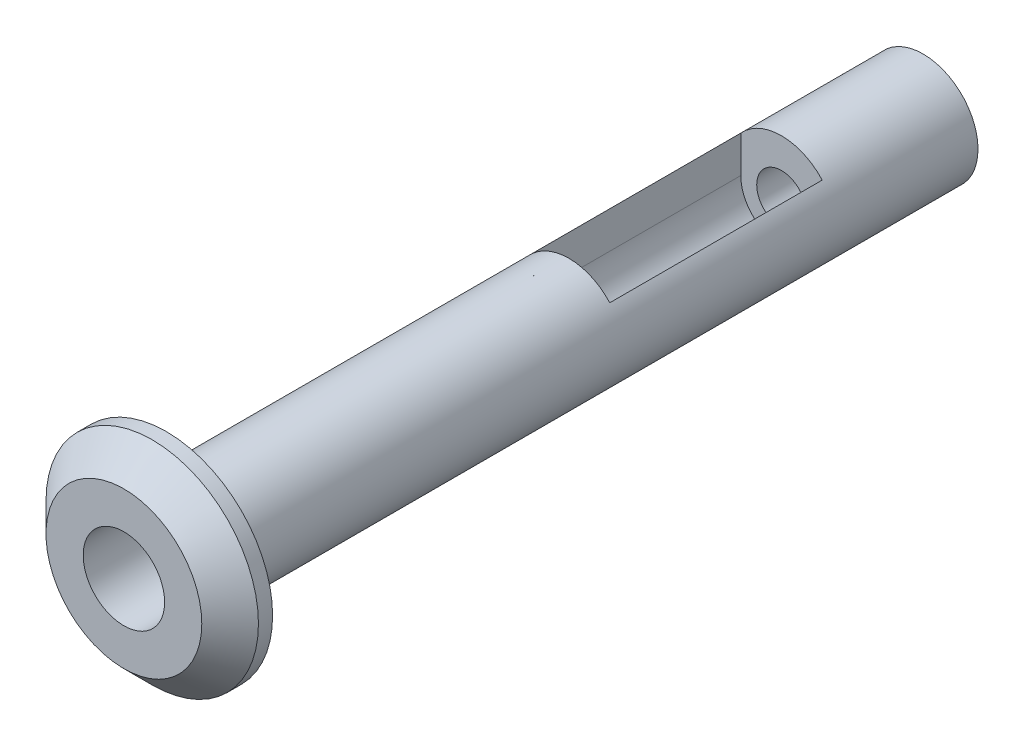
ISO-10303-21;
HEADER;
FILE_DESCRIPTION(('STEP AP214'),'2;1');
FILE_NAME('part.step','',(''),(''),'','','');
FILE_SCHEMA(('AUTOMOTIVE_DESIGN { 1 0 10303 214 1 1 1 1 }'));
ENDSEC;
DATA;
#1=APPLICATION_CONTEXT('core data for automotive mechanical design processes');
#2=APPLICATION_PROTOCOL_DEFINITION('international standard','automotive_design',2000,#1);
#3=PRODUCT_CONTEXT('',#1,'mechanical');
#4=PRODUCT('Part','Part','',(#3));
#5=PRODUCT_RELATED_PRODUCT_CATEGORY('part','',(#4));
#6=PRODUCT_DEFINITION_FORMATION('','',#4);
#7=PRODUCT_DEFINITION_CONTEXT('part definition',#1,'design');
#8=PRODUCT_DEFINITION('design','',#6,#7);
#9=PRODUCT_DEFINITION_SHAPE('','',#8);
#10=(LENGTH_UNIT() NAMED_UNIT(*) SI_UNIT(.MILLI.,.METRE.));
#11=(NAMED_UNIT(*) PLANE_ANGLE_UNIT() SI_UNIT($,.RADIAN.));
#12=(NAMED_UNIT(*) SI_UNIT($,.STERADIAN.) SOLID_ANGLE_UNIT());
#13=UNCERTAINTY_MEASURE_WITH_UNIT(LENGTH_MEASURE(1.E-05),#10,'distance_accuracy_value','');
#14=(GEOMETRIC_REPRESENTATION_CONTEXT(3) GLOBAL_UNCERTAINTY_ASSIGNED_CONTEXT((#13)) GLOBAL_UNIT_ASSIGNED_CONTEXT((#10,
#11,#12)) REPRESENTATION_CONTEXT('',''));
#15=CARTESIAN_POINT('',(0.,0.,0.));
#16=DIRECTION('',(0.,0.,1.));
#17=DIRECTION('',(1.,0.,0.));
#18=AXIS2_PLACEMENT_3D('',#15,#16,#17);
#19=CARTESIAN_POINT('',(0.,0.,-1.5));
#20=DIRECTION('',(0.,0.,1.));
#21=DIRECTION('',(1.,0.,0.));
#22=AXIS2_PLACEMENT_3D('',#19,#20,#21);
#23=PLANE('',#22);
#24=CARTESIAN_POINT('',(0.,0.,-1.5));
#25=DIRECTION('',(0.,0.,1.));
#26=DIRECTION('',(1.,0.,0.));
#27=AXIS2_PLACEMENT_3D('',#24,#25,#26);
#28=CIRCLE('',#27,7.5);
#29=CARTESIAN_POINT('',(7.5,0.,-1.5));
#30=VERTEX_POINT('',#29);
#31=EDGE_CURVE('E123',#30,#30,#28,.T.);
#32=ORIENTED_EDGE('',*,*,#31,.F.);
#33=EDGE_LOOP('',(#32));
#34=FACE_BOUND('',#33,.T.);
#35=CARTESIAN_POINT('',(0.,0.,-1.5));
#36=DIRECTION('',(0.,0.,1.));
#37=DIRECTION('',(1.,0.,0.));
#38=AXIS2_PLACEMENT_3D('',#35,#36,#37);
#39=CIRCLE('',#38,3.875);
#40=CARTESIAN_POINT('',(3.875,0.,-1.5));
#41=VERTEX_POINT('',#40);
#42=EDGE_CURVE('E49',#41,#41,#39,.F.);
#43=ORIENTED_EDGE('',*,*,#42,.F.);
#44=EDGE_LOOP('',(#43));
#45=FACE_BOUND('',#44,.T.);
#46=ADVANCED_FACE('F40',(#34,#45),#23,.F.);
#47=CARTESIAN_POINT('',(0.,0.,1.5));
#48=DIRECTION('',(0.,0.,1.));
#49=DIRECTION('',(1.,0.,0.));
#50=AXIS2_PLACEMENT_3D('',#47,#48,#49);
#51=PLANE('',#50);
#52=CARTESIAN_POINT('',(0.,0.,1.5));
#53=DIRECTION('',(0.,0.,1.));
#54=DIRECTION('',(1.,0.,0.));
#55=AXIS2_PLACEMENT_3D('',#52,#53,#54);
#56=CIRCLE('',#55,2.875);
#57=CARTESIAN_POINT('',(2.875,0.,1.5));
#58=VERTEX_POINT('',#57);
#59=EDGE_CURVE('E91',#58,#58,#56,.T.);
#60=ORIENTED_EDGE('',*,*,#59,.F.);
#61=EDGE_LOOP('',(#60));
#62=FACE_BOUND('',#61,.T.);
#63=CARTESIAN_POINT('',(0.,0.,1.5));
#64=DIRECTION('',(0.,0.,1.));
#65=DIRECTION('',(1.,0.,0.));
#66=AXIS2_PLACEMENT_3D('',#63,#64,#65);
#67=CIRCLE('',#66,5.5);
#68=CARTESIAN_POINT('',(5.5,0.,1.5));
#69=VERTEX_POINT('',#68);
#70=EDGE_CURVE('E126',#69,#69,#67,.T.);
#71=ORIENTED_EDGE('',*,*,#70,.T.);
#72=EDGE_LOOP('',(#71));
#73=FACE_BOUND('',#72,.T.);
#74=ADVANCED_FACE('F159',(#62,#73),#51,.T.);
#75=CARTESIAN_POINT('',(0.,0.,1.5));
#76=DIRECTION('',(0.,0.,-1.));
#77=DIRECTION('',(-1.,0.,0.));
#78=AXIS2_PLACEMENT_3D('',#75,#76,#77);
#79=CYLINDRICAL_SURFACE('',#78,7.5);
#80=CARTESIAN_POINT('',(0.,0.,-0.500000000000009));
#81=DIRECTION('',(0.,0.,1.));
#82=DIRECTION('',(1.,0.,0.));
#83=AXIS2_PLACEMENT_3D('',#80,#81,#82);
#84=CIRCLE('',#83,7.5);
#85=CARTESIAN_POINT('',(7.5,0.,-0.500000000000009));
#86=VERTEX_POINT('',#85);
#87=EDGE_CURVE('E129',#86,#86,#84,.F.);
#88=ORIENTED_EDGE('',*,*,#87,.T.);
#89=EDGE_LOOP('',(#88));
#90=FACE_BOUND('',#89,.T.);
#91=ORIENTED_EDGE('',*,*,#31,.T.);
#92=EDGE_LOOP('',(#91));
#93=FACE_BOUND('',#92,.T.);
#94=ADVANCED_FACE('F141',(#90,#93),#79,.T.);
#95=CARTESIAN_POINT('',(0.,0.,1.5));
#96=DIRECTION('',(0.,0.,-1.));
#97=DIRECTION('',(-1.,0.,0.));
#98=AXIS2_PLACEMENT_3D('',#95,#96,#97);
#99=CYLINDRICAL_SURFACE('',#98,1.75);
#100=CARTESIAN_POINT('',(0.,0.,-44.93));
#101=DIRECTION('',(0.,0.,-1.));
#102=DIRECTION('',(-1.,0.,0.));
#103=AXIS2_PLACEMENT_3D('',#100,#101,#102);
#104=CIRCLE('',#103,1.75);
#105=CARTESIAN_POINT('',(-1.75,0.,-44.93));
#106=VERTEX_POINT('',#105);
#107=EDGE_CURVE('E116',#106,#106,#104,.T.);
#108=ORIENTED_EDGE('',*,*,#107,.F.);
#109=EDGE_LOOP('',(#108));
#110=FACE_BOUND('',#109,.T.);
#111=CARTESIAN_POINT('',(0.,0.,-54.93));
#112=DIRECTION('',(0.,0.,-1.));
#113=DIRECTION('',(-1.,0.,0.));
#114=AXIS2_PLACEMENT_3D('',#111,#112,#113);
#115=CIRCLE('',#114,1.75);
#116=CARTESIAN_POINT('',(-1.75,0.,-54.93));
#117=VERTEX_POINT('',#116);
#118=EDGE_CURVE('E117',#117,#117,#115,.T.);
#119=ORIENTED_EDGE('',*,*,#118,.T.);
#120=EDGE_LOOP('',(#119));
#121=FACE_BOUND('',#120,.T.);
#122=ADVANCED_FACE('F138',(#110,#121),#99,.F.);
#123=CARTESIAN_POINT('',(0.,0.,1.5));
#124=DIRECTION('',(0.,0.,-1.));
#125=DIRECTION('',(-1.,0.,0.));
#126=AXIS2_PLACEMENT_3D('',#123,#124,#125);
#127=CONICAL_SURFACE('',#126,5.5,0.785398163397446);
#128=ORIENTED_EDGE('',*,*,#87,.F.);
#129=EDGE_LOOP('',(#128));
#130=FACE_BOUND('',#129,.T.);
#131=ORIENTED_EDGE('',*,*,#70,.F.);
#132=EDGE_LOOP('',(#131));
#133=FACE_BOUND('',#132,.T.);
#134=ADVANCED_FACE('F43',(#130,#133),#127,.T.);
#135=CARTESIAN_POINT('',(0.,0.,-54.93));
#136=DIRECTION('',(0.,0.,-1.));
#137=DIRECTION('',(-1.,0.,0.));
#138=AXIS2_PLACEMENT_3D('',#135,#136,#137);
#139=PLANE('',#138);
#140=CARTESIAN_POINT('',(0.,0.,-54.93));
#141=DIRECTION('',(0.,0.,-1.));
#142=DIRECTION('',(-1.,0.,0.));
#143=AXIS2_PLACEMENT_3D('',#140,#141,#142);
#144=CIRCLE('',#143,3.875);
#145=CARTESIAN_POINT('',(-3.875,0.,-54.93));
#146=VERTEX_POINT('',#145);
#147=EDGE_CURVE('E120',#146,#146,#144,.T.);
#148=ORIENTED_EDGE('',*,*,#147,.T.);
#149=EDGE_LOOP('',(#148));
#150=FACE_BOUND('',#149,.T.);
#151=ORIENTED_EDGE('',*,*,#118,.F.);
#152=EDGE_LOOP('',(#151));
#153=FACE_BOUND('',#152,.T.);
#154=ADVANCED_FACE('F145',(#150,#153),#139,.T.);
#155=CARTESIAN_POINT('',(0.,0.,-54.93));
#156=DIRECTION('',(0.,0.,1.));
#157=DIRECTION('',(1.,0.,0.));
#158=AXIS2_PLACEMENT_3D('',#155,#156,#157);
#159=CYLINDRICAL_SURFACE('',#158,3.875);
#160=DIRECTION('',(0.,0.,-1.));
#161=VECTOR('',#160,1.);
#162=CARTESIAN_POINT('',(2.875,2.59807621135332,-29.93));
#163=LINE('',#162,#161);
#164=CARTESIAN_POINT('',(2.875,2.59807621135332,-29.93));
#165=VERTEX_POINT('',#164);
#166=CARTESIAN_POINT('',(2.875,2.59807621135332,-44.93));
#167=VERTEX_POINT('',#166);
#168=EDGE_CURVE('E56',#165,#167,#163,.T.);
#169=ORIENTED_EDGE('',*,*,#168,.F.);
#170=CARTESIAN_POINT('',(0.,0.,-29.93));
#171=DIRECTION('',(0.,0.,1.));
#172=DIRECTION('',(-1.,0.,0.));
#173=AXIS2_PLACEMENT_3D('',#170,#171,#172);
#174=CIRCLE('',#173,3.875);
#175=CARTESIAN_POINT('',(-2.875,2.59807621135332,-29.93));
#176=VERTEX_POINT('',#175);
#177=EDGE_CURVE('E97',#165,#176,#174,.T.);
#178=ORIENTED_EDGE('',*,*,#177,.T.);
#179=DIRECTION('',(0.,0.,-1.));
#180=VECTOR('',#179,1.);
#181=CARTESIAN_POINT('',(-2.875,2.59807621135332,-29.93));
#182=LINE('',#181,#180);
#183=CARTESIAN_POINT('',(-2.875,2.59807621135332,-44.93));
#184=VERTEX_POINT('',#183);
#185=EDGE_CURVE('E103',#176,#184,#182,.T.);
#186=ORIENTED_EDGE('',*,*,#185,.T.);
#187=CARTESIAN_POINT('',(0.,0.,-44.93));
#188=DIRECTION('',(0.,0.,1.));
#189=DIRECTION('',(-1.,0.,0.));
#190=AXIS2_PLACEMENT_3D('',#187,#188,#189);
#191=CIRCLE('',#190,3.875);
#192=EDGE_CURVE('E283',#167,#184,#191,.T.);
#193=ORIENTED_EDGE('',*,*,#192,.F.);
#194=EDGE_LOOP('',(#169,#178,#186,#193));
#195=FACE_BOUND('',#194,.T.);
#196=ORIENTED_EDGE('',*,*,#147,.F.);
#197=EDGE_LOOP('',(#196));
#198=FACE_BOUND('',#197,.T.);
#199=ORIENTED_EDGE('',*,*,#42,.T.);
#200=EDGE_LOOP('',(#199));
#201=FACE_BOUND('',#200,.T.);
#202=ADVANCED_FACE('F147',(#195,#198,#201),#159,.T.);
#203=CARTESIAN_POINT('',(0.,0.,-44.93));
#204=DIRECTION('',(0.,0.,-1.));
#205=DIRECTION('',(-1.,0.,0.));
#206=AXIS2_PLACEMENT_3D('',#203,#204,#205);
#207=PLANE('',#206);
#208=CARTESIAN_POINT('',(0.,0.,-44.93));
#209=DIRECTION('',(0.,0.,-1.));
#210=DIRECTION('',(-1.,0.,0.));
#211=AXIS2_PLACEMENT_3D('',#208,#209,#210);
#212=CIRCLE('',#211,2.875);
#213=CARTESIAN_POINT('',(-2.875,0.,-44.93));
#214=VERTEX_POINT('',#213);
#215=CARTESIAN_POINT('',(2.875,0.,-44.93));
#216=VERTEX_POINT('',#215);
#217=EDGE_CURVE('E102',#214,#216,#212,.F.);
#218=ORIENTED_EDGE('',*,*,#217,.T.);
#219=DIRECTION('',(0.,1.,0.));
#220=VECTOR('',#219,1.);
#221=CARTESIAN_POINT('',(2.875,0.,-44.93));
#222=LINE('',#221,#220);
#223=EDGE_CURVE('E87',#216,#167,#222,.T.);
#224=ORIENTED_EDGE('',*,*,#223,.T.);
#225=ORIENTED_EDGE('',*,*,#192,.T.);
#226=DIRECTION('',(0.,-1.,0.));
#227=VECTOR('',#226,1.);
#228=CARTESIAN_POINT('',(-2.875,0.,-44.93));
#229=LINE('',#228,#227);
#230=EDGE_CURVE('E98',#184,#214,#229,.T.);
#231=ORIENTED_EDGE('',*,*,#230,.T.);
#232=EDGE_LOOP('',(#218,#224,#225,#231));
#233=FACE_BOUND('',#232,.T.);
#234=ORIENTED_EDGE('',*,*,#107,.T.);
#235=EDGE_LOOP('',(#234));
#236=FACE_BOUND('',#235,.T.);
#237=ADVANCED_FACE('F136',(#233,#236),#207,.F.);
#238=CARTESIAN_POINT('',(0.,0.,-63.0617279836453));
#239=DIRECTION('',(0.,0.,1.));
#240=DIRECTION('',(1.,0.,0.));
#241=AXIS2_PLACEMENT_3D('',#238,#239,#240);
#242=CYLINDRICAL_SURFACE('',#241,2.875);
#243=CARTESIAN_POINT('',(0.,0.,-29.93));
#244=DIRECTION('',(0.,0.,1.));
#245=DIRECTION('',(1.,0.,0.));
#246=AXIS2_PLACEMENT_3D('',#243,#244,#245);
#247=CIRCLE('',#246,2.875);
#248=CARTESIAN_POINT('',(-2.875,0.,-29.93));
#249=VERTEX_POINT('',#248);
#250=CARTESIAN_POINT('',(2.875,0.,-29.93));
#251=VERTEX_POINT('',#250);
#252=EDGE_CURVE('E12',#249,#251,#247,.F.);
#253=ORIENTED_EDGE('',*,*,#252,.T.);
#254=DIRECTION('',(0.,0.,-1.));
#255=VECTOR('',#254,1.);
#256=CARTESIAN_POINT('',(2.875,0.,-29.93));
#257=LINE('',#256,#255);
#258=EDGE_CURVE('E82',#251,#216,#257,.T.);
#259=ORIENTED_EDGE('',*,*,#258,.T.);
#260=ORIENTED_EDGE('',*,*,#217,.F.);
#261=DIRECTION('',(0.,0.,-1.));
#262=VECTOR('',#261,1.);
#263=CARTESIAN_POINT('',(-2.875,0.,-29.93));
#264=LINE('',#263,#262);
#265=EDGE_CURVE('E64',#249,#214,#264,.T.);
#266=ORIENTED_EDGE('',*,*,#265,.F.);
#267=EDGE_LOOP('',(#253,#259,#260,#266));
#268=FACE_BOUND('',#267,.T.);
#269=ORIENTED_EDGE('',*,*,#59,.T.);
#270=EDGE_LOOP('',(#269));
#271=FACE_BOUND('',#270,.T.);
#272=ADVANCED_FACE('F100',(#268,#271),#242,.F.);
#273=CARTESIAN_POINT('',(0.,0.,-29.93));
#274=DIRECTION('',(0.,0.,1.));
#275=DIRECTION('',(1.,0.,0.));
#276=AXIS2_PLACEMENT_3D('',#273,#274,#275);
#277=PLANE('',#276);
#278=DIRECTION('',(0.,-1.,0.));
#279=VECTOR('',#278,1.);
#280=CARTESIAN_POINT('',(-2.875,0.,-29.93));
#281=LINE('',#280,#279);
#282=EDGE_CURVE('E104',#176,#249,#281,.T.);
#283=ORIENTED_EDGE('',*,*,#282,.F.);
#284=ORIENTED_EDGE('',*,*,#177,.F.);
#285=DIRECTION('',(0.,1.,0.));
#286=VECTOR('',#285,1.);
#287=CARTESIAN_POINT('',(2.875,0.,-29.93));
#288=LINE('',#287,#286);
#289=EDGE_CURVE('E85',#251,#165,#288,.T.);
#290=ORIENTED_EDGE('',*,*,#289,.F.);
#291=ORIENTED_EDGE('',*,*,#252,.F.);
#292=EDGE_LOOP('',(#283,#284,#290,#291));
#293=FACE_BOUND('',#292,.T.);
#294=ADVANCED_FACE('F95',(#293),#277,.F.);
#295=CARTESIAN_POINT('',(2.875,0.,-29.93));
#296=DIRECTION('',(-1.,0.,0.));
#297=DIRECTION('',(0.,0.,1.));
#298=AXIS2_PLACEMENT_3D('',#295,#296,#297);
#299=PLANE('',#298);
#300=ORIENTED_EDGE('',*,*,#223,.F.);
#301=ORIENTED_EDGE('',*,*,#258,.F.);
#302=ORIENTED_EDGE('',*,*,#289,.T.);
#303=ORIENTED_EDGE('',*,*,#168,.T.);
#304=EDGE_LOOP('',(#300,#301,#302,#303));
#305=FACE_BOUND('',#304,.T.);
#306=ADVANCED_FACE('F84',(#305),#299,.T.);
#307=CARTESIAN_POINT('',(-2.875,0.,-29.93));
#308=DIRECTION('',(1.,0.,0.));
#309=DIRECTION('',(0.,0.,-1.));
#310=AXIS2_PLACEMENT_3D('',#307,#308,#309);
#311=PLANE('',#310);
#312=ORIENTED_EDGE('',*,*,#230,.F.);
#313=ORIENTED_EDGE('',*,*,#185,.F.);
#314=ORIENTED_EDGE('',*,*,#282,.T.);
#315=ORIENTED_EDGE('',*,*,#265,.T.);
#316=EDGE_LOOP('',(#312,#313,#314,#315));
#317=FACE_BOUND('',#316,.T.);
#318=ADVANCED_FACE('F266',(#317),#311,.T.);
#319=CLOSED_SHELL('',(#46,#74,#94,#122,#134,#154,#202,#237,#272,#294,#306,#318));
#320=MANIFOLD_SOLID_BREP('B2',#319);
#321=ADVANCED_BREP_SHAPE_REPRESENTATION('',(#18,#320),#14);
#322=SHAPE_DEFINITION_REPRESENTATION(#9,#321);
ENDSEC;
END-ISO-10303-21;
